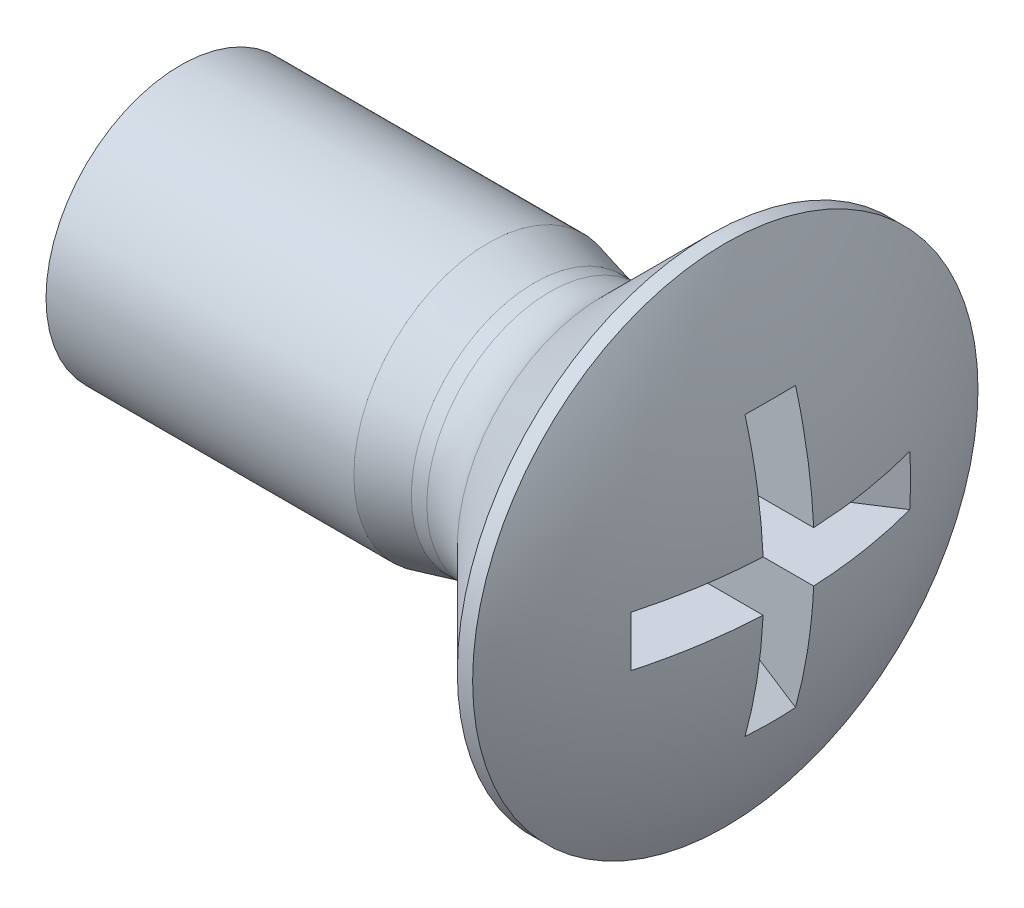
ISO-10303-21;
HEADER;
FILE_DESCRIPTION(('STEP AP214'),'2;1');
FILE_NAME('part.step','',(''),(''),'','','');
FILE_SCHEMA(('AUTOMOTIVE_DESIGN { 1 0 10303 214 1 1 1 1 }'));
ENDSEC;
DATA;
#1=APPLICATION_CONTEXT('core data for automotive mechanical design processes');
#2=APPLICATION_PROTOCOL_DEFINITION('international standard','automotive_design',2000,#1);
#3=PRODUCT_CONTEXT('',#1,'mechanical');
#4=PRODUCT('Part','Part','',(#3));
#5=PRODUCT_RELATED_PRODUCT_CATEGORY('part','',(#4));
#6=PRODUCT_DEFINITION_FORMATION('','',#4);
#7=PRODUCT_DEFINITION_CONTEXT('part definition',#1,'design');
#8=PRODUCT_DEFINITION('design','',#6,#7);
#9=PRODUCT_DEFINITION_SHAPE('','',#8);
#10=(LENGTH_UNIT() NAMED_UNIT(*) SI_UNIT(.MILLI.,.METRE.));
#11=(NAMED_UNIT(*) PLANE_ANGLE_UNIT() SI_UNIT($,.RADIAN.));
#12=(NAMED_UNIT(*) SI_UNIT($,.STERADIAN.) SOLID_ANGLE_UNIT());
#13=UNCERTAINTY_MEASURE_WITH_UNIT(LENGTH_MEASURE(1.E-05),#10,'distance_accuracy_value','');
#14=(GEOMETRIC_REPRESENTATION_CONTEXT(3) GLOBAL_UNCERTAINTY_ASSIGNED_CONTEXT((#13)) GLOBAL_UNIT_ASSIGNED_CONTEXT((#10,
#11,#12)) REPRESENTATION_CONTEXT('',''));
#15=CARTESIAN_POINT('',(0.,0.,0.));
#16=DIRECTION('',(0.,0.,1.));
#17=DIRECTION('',(1.,0.,0.));
#18=AXIS2_PLACEMENT_3D('',#15,#16,#17);
#19=CARTESIAN_POINT('',(8.,-15.525,15.8));
#20=DIRECTION('',(0.,1.,0.));
#21=DIRECTION('',(0.,0.,1.));
#22=AXIS2_PLACEMENT_3D('',#19,#20,#21);
#23=PLANE('',#22);
#24=CARTESIAN_POINT('',(8.41850821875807,-15.525,17.3176700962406));
#25=CARTESIAN_POINT('',(8.46403024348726,-15.525,17.1513480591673));
#26=CARTESIAN_POINT('',(8.5019567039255,-15.525,16.9836632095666));
#27=CARTESIAN_POINT('',(8.56261849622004,-15.525,16.6455678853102));
#28=CARTESIAN_POINT('',(8.58535382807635,-15.525,16.4751574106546));
#29=CARTESIAN_POINT('',(8.6004935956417,-15.525,16.3033841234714));
#30=B_SPLINE_CURVE_WITH_KNOTS('',3,(#24,#25,#26,#27,#28,#29),.UNSPECIFIED.,.F.,.F.,(4,2,4),(0.,
0.515761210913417,1.03152242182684),.UNSPECIFIED.);
#31=CARTESIAN_POINT('',(8.41850821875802,-15.5249999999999,17.3176700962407));
#32=VERTEX_POINT('',#31);
#33=CARTESIAN_POINT('',(8.60049359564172,-15.525,16.3033841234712));
#34=VERTEX_POINT('',#33);
#35=EDGE_CURVE('E21',#32,#34,#30,.T.);
#36=ORIENTED_EDGE('',*,*,#35,.F.);
#37=DIRECTION('',(-0.839314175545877,0.,-0.54364668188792));
#38=VECTOR('',#37,1.);
#39=CARTESIAN_POINT('',(8.7,-15.525,17.5));
#40=LINE('',#39,#38);
#41=CARTESIAN_POINT('',(6.50000000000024,-15.5250000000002,16.0749999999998));
#42=VERTEX_POINT('',#41);
#43=EDGE_CURVE('E124',#42,#32,#40,.F.);
#44=ORIENTED_EDGE('',*,*,#43,.F.);
#45=DIRECTION('',(1.,0.,0.));
#46=VECTOR('',#45,1.);
#47=CARTESIAN_POINT('',(8.,-15.525,16.075));
#48=LINE('',#47,#46);
#49=CARTESIAN_POINT('',(8.616003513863,-15.525,16.075));
#50=VERTEX_POINT('',#49);
#51=EDGE_CURVE('E118',#50,#42,#48,.F.);
#52=ORIENTED_EDGE('',*,*,#51,.F.);
#53=CARTESIAN_POINT('',(8.600493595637,-15.525,16.303384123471));
#54=CARTESIAN_POINT('',(8.61052392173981,-15.525,16.1893465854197));
#55=CARTESIAN_POINT('',(8.616003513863,-15.525,16.075));
#56=B_SPLINE_CURVE_WITH_KNOTS('',2,(#53,#54,#55),.UNSPECIFIED.,.F.,.F.,(3,3),(0.,1.),.UNSPECIFIED.);
#57=EDGE_CURVE('E121',#34,#50,#56,.T.);
#58=ORIENTED_EDGE('',*,*,#57,.F.);
#59=EDGE_LOOP('',(#36,#44,#52,#58));
#60=FACE_BOUND('',#59,.T.);
#61=ADVANCED_FACE('F17',(#60),#23,.F.);
#62=CARTESIAN_POINT('',(8.,-15.8,16.075));
#63=DIRECTION('',(0.,0.,-1.));
#64=DIRECTION('',(0.,1.,0.));
#65=AXIS2_PLACEMENT_3D('',#62,#63,#64);
#66=PLANE('',#65);
#67=DIRECTION('',(0.839314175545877,0.54364668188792,0.));
#68=VECTOR('',#67,1.);
#69=CARTESIAN_POINT('',(8.7,-14.1,16.075));
#70=LINE('',#69,#68);
#71=CARTESIAN_POINT('',(8.41850671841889,-14.2823315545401,16.075));
#72=VERTEX_POINT('',#71);
#73=EDGE_CURVE('E93',#72,#42,#70,.F.);
#74=ORIENTED_EDGE('',*,*,#73,.F.);
#75=CARTESIAN_POINT('',(8.41850853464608,-14.2823310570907,16.075));
#76=CARTESIAN_POINT('',(8.43242250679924,-14.3331313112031,16.075));
#77=CARTESIAN_POINT('',(8.44563750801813,-14.3841229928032,16.075));
#78=CARTESIAN_POINT('',(8.47063224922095,-14.4863352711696,16.075));
#79=CARTESIAN_POINT('',(8.48241515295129,-14.5375550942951,16.075));
#80=CARTESIAN_POINT('',(8.50455447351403,-14.6402216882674,16.075));
#81=CARTESIAN_POINT('',(8.51491300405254,-14.6916680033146,16.075));
#82=CARTESIAN_POINT('',(8.53420944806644,-14.7947862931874,16.075));
#83=CARTESIAN_POINT('',(8.54314842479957,-14.8464580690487,16.075));
#84=CARTESIAN_POINT('',(8.55960843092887,-14.9500269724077,16.075));
#85=CARTESIAN_POINT('',(8.56712946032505,-15.0019240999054,16.075));
#86=CARTESIAN_POINT('',(8.58075308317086,-15.1059439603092,16.075));
#87=CARTESIAN_POINT('',(8.58685460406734,-15.1580668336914,16.075));
#88=CARTESIAN_POINT('',(8.59763538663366,-15.262538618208,16.075));
#89=CARTESIAN_POINT('',(8.60231249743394,-15.3148877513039,16.075));
#90=CARTESIAN_POINT('',(8.61023770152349,-15.4198128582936,16.075));
#91=CARTESIAN_POINT('',(8.6134825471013,-15.4723890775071,16.075));
#92=CARTESIAN_POINT('',(8.61600351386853,-15.5249999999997,16.075));
#93=B_SPLINE_CURVE_WITH_KNOTS('',3,(#75,#76,#77,#78,#79,#80,#81,#82,#83,#84,#85,#86,#87,#88,#89,
#90,#91,#92),.UNSPECIFIED.,.F.,.F.,(4,2,2,2,2,2,2,2,4),(0.,0.15800885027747,0.315662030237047,
0.473078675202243,0.630376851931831,0.787675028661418,0.945091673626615,1.10274485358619,
1.26075370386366),.UNSPECIFIED.);
#94=EDGE_CURVE('E120',#72,#50,#93,.T.);
#95=ORIENTED_EDGE('',*,*,#94,.T.);
#96=ORIENTED_EDGE('',*,*,#51,.T.);
#97=EDGE_LOOP('',(#74,#95,#96));
#98=FACE_BOUND('',#97,.T.);
#99=ADVANCED_FACE('F119',(#98),#66,.T.);
#100=CARTESIAN_POINT('',(8.7,-15.8,17.5));
#101=DIRECTION('',(0.54364668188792,0.,-0.839314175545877));
#102=DIRECTION('',(-0.839314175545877,0.,-0.54364668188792));
#103=AXIS2_PLACEMENT_3D('',#100,#101,#102);
#104=PLANE('',#103);
#105=ORIENTED_EDGE('',*,*,#43,.T.);
#106=CARTESIAN_POINT('',(8.41850821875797,-15.5249999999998,17.3176700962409));
#107=CARTESIAN_POINT('',(8.42236962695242,-15.6166666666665,17.3201712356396));
#108=CARTESIAN_POINT('',(8.42430033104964,-15.7083333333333,17.3214218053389));
#109=CARTESIAN_POINT('',(8.42430033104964,-15.8916666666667,17.3214218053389));
#110=CARTESIAN_POINT('',(8.42236962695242,-15.9833333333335,17.3201712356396));
#111=CARTESIAN_POINT('',(8.41850821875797,-16.0750000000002,17.3176700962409));
#112=B_SPLINE_CURVE_WITH_KNOTS('',3,(#106,#107,#108,#109,#110,#111),.UNSPECIFIED.,.F.,.F.,(4,2,
4),(0.,0.275086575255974,0.550173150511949),.UNSPECIFIED.);
#113=CARTESIAN_POINT('',(8.41850821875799,-16.0750000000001,17.3176700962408));
#114=VERTEX_POINT('',#113);
#115=EDGE_CURVE('E103',#32,#114,#112,.T.);
#116=ORIENTED_EDGE('',*,*,#115,.T.);
#117=DIRECTION('',(0.839314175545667,0.,0.543646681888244));
#118=VECTOR('',#117,1.);
#119=CARTESIAN_POINT('',(6.5,-16.075,16.075));
#120=LINE('',#119,#118);
#121=CARTESIAN_POINT('',(6.50000000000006,-16.075,16.0749999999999));
#122=VERTEX_POINT('',#121);
#123=EDGE_CURVE('E129',#122,#114,#120,.T.);
#124=ORIENTED_EDGE('',*,*,#123,.F.);
#125=DIRECTION('',(0.,1.,0.));
#126=VECTOR('',#125,1.);
#127=CARTESIAN_POINT('',(6.5000000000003,-15.8,16.0749999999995));
#128=LINE('',#127,#126);
#129=EDGE_CURVE('E111',#122,#42,#128,.T.);
#130=ORIENTED_EDGE('',*,*,#129,.T.);
#131=EDGE_LOOP('',(#105,#116,#124,#130));
#132=FACE_BOUND('',#131,.T.);
#133=ADVANCED_FACE('F127',(#132),#104,.T.);
#134=CARTESIAN_POINT('',(8.7,-14.1,15.8));
#135=DIRECTION('',(0.54364668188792,-0.839314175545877,0.));
#136=DIRECTION('',(0.839314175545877,0.54364668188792,0.));
#137=AXIS2_PLACEMENT_3D('',#134,#135,#136);
#138=PLANE('',#137);
#139=DIRECTION('',(0.839314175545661,0.543646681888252,0.));
#140=VECTOR('',#139,1.);
#141=CARTESIAN_POINT('',(6.5,-15.525,15.525));
#142=LINE('',#141,#140);
#143=CARTESIAN_POINT('',(6.50000000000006,-15.5250000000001,15.525));
#144=VERTEX_POINT('',#143);
#145=CARTESIAN_POINT('',(8.41850789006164,-14.2823301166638,15.524999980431));
#146=VERTEX_POINT('',#145);
#147=EDGE_CURVE('E233',#144,#146,#142,.T.);
#148=ORIENTED_EDGE('',*,*,#147,.T.);
#149=CARTESIAN_POINT('',(8.41850821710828,-14.2823299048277,15.5249999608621));
#150=CARTESIAN_POINT('',(8.4223696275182,-14.279828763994,15.61666666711));
#151=CARTESIAN_POINT('',(8.42430033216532,-14.2785781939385,15.7083333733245));
#152=CARTESIAN_POINT('',(8.42430032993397,-14.2785781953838,15.8916667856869));
#153=CARTESIAN_POINT('',(8.42236962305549,-14.2798287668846,15.9833334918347));
#154=CARTESIAN_POINT('',(8.41850821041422,-14.2823299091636,16.0750001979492));
#155=B_SPLINE_CURVE_WITH_KNOTS('',3,(#149,#150,#151,#152,#153,#154),.UNSPECIFIED.,.F.,.F.,(4,2,
4),(0.,0.275086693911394,0.55017338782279),.UNSPECIFIED.);
#156=EDGE_CURVE('E99',#146,#72,#155,.T.);
#157=ORIENTED_EDGE('',*,*,#156,.T.);
#158=ORIENTED_EDGE('',*,*,#73,.T.);
#159=DIRECTION('',(0.,0.,1.));
#160=VECTOR('',#159,1.);
#161=CARTESIAN_POINT('',(6.5000000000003,-15.5250000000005,15.8));
#162=LINE('',#161,#160);
#163=EDGE_CURVE('E97',#42,#144,#162,.F.);
#164=ORIENTED_EDGE('',*,*,#163,.T.);
#165=EDGE_LOOP('',(#148,#157,#158,#164));
#166=FACE_BOUND('',#165,.T.);
#167=ADVANCED_FACE('F96',(#166),#138,.T.);
#168=CARTESIAN_POINT('',(8.,-16.075,15.8));
#169=DIRECTION('',(0.,1.,0.));
#170=DIRECTION('',(0.,0.,1.));
#171=AXIS2_PLACEMENT_3D('',#168,#169,#170);
#172=PLANE('',#171);
#173=ORIENTED_EDGE('',*,*,#123,.T.);
#174=CARTESIAN_POINT('',(8.418508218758,-16.075,17.3176700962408));
#175=CARTESIAN_POINT('',(8.43242221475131,-16.075,17.2668697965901));
#176=CARTESIAN_POINT('',(8.44563723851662,-16.075,17.215878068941));
#177=CARTESIAN_POINT('',(8.47063202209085,-16.075,17.113665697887));
#178=CARTESIAN_POINT('',(8.48241494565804,-16.075,17.0624458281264));
#179=CARTESIAN_POINT('',(8.50455430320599,-16.075,16.9597791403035));
#180=CARTESIAN_POINT('',(8.51491285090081,-16.075,16.9083327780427));
#181=CARTESIAN_POINT('',(8.53420932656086,-16.075,16.8052143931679));
#182=CARTESIAN_POINT('',(8.54314831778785,-16.075,16.7535425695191));
#183=CARTESIAN_POINT('',(8.55960835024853,-16.075,16.6499735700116));
#184=CARTESIAN_POINT('',(8.56712939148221,-16.075,16.598076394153));
#185=CARTESIAN_POINT('',(8.58075303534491,-16.075,16.4940564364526));
#186=CARTESIAN_POINT('',(8.58685456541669,-16.075,16.4419335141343));
#187=CARTESIAN_POINT('',(8.59763536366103,-16.075,16.3374616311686));
#188=CARTESIAN_POINT('',(8.60231248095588,-16.075,16.2851124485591));
#189=CARTESIAN_POINT('',(8.6102376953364,-16.075,16.1801872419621));
#190=CARTESIAN_POINT('',(8.61348254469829,-16.075,16.1276109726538));
#191=CARTESIAN_POINT('',(8.61600351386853,-16.075,16.0750000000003));
#192=B_SPLINE_CURVE_WITH_KNOTS('',3,(#174,#175,#176,#177,#178,#179,#180,#181,#182,#183,#184,
#185,#186,#187,#188,#189,#190,#191),.UNSPECIFIED.,.F.,.F.,(4,2,2,2,2,2,2,2,4),(0.,
0.158009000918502,0.315662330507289,0.473079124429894,0.630377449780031,0.787675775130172,
0.945092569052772,1.10274589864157,1.26075489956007),.UNSPECIFIED.);
#193=CARTESIAN_POINT('',(8.61600351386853,-16.0750000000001,16.0750000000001));
#194=VERTEX_POINT('',#193);
#195=EDGE_CURVE('E235',#114,#194,#192,.T.);
#196=ORIENTED_EDGE('',*,*,#195,.T.);
#197=DIRECTION('',(1.,0.,0.));
#198=VECTOR('',#197,1.);
#199=CARTESIAN_POINT('',(8.,-16.075,16.075));
#200=LINE('',#199,#198);
#201=EDGE_CURVE('E227',#122,#194,#200,.T.);
#202=ORIENTED_EDGE('',*,*,#201,.F.);
#203=EDGE_LOOP('',(#173,#196,#202));
#204=FACE_BOUND('',#203,.T.);
#205=ADVANCED_FACE('F266',(#204),#172,.T.);
#206=CARTESIAN_POINT('',(8.,-15.8,15.525));
#207=DIRECTION('',(0.,0.,-1.));
#208=DIRECTION('',(0.,1.,0.));
#209=AXIS2_PLACEMENT_3D('',#206,#207,#208);
#210=PLANE('',#209);
#211=ORIENTED_EDGE('',*,*,#147,.F.);
#212=DIRECTION('',(1.,0.,0.));
#213=VECTOR('',#212,1.);
#214=CARTESIAN_POINT('',(8.,-15.525,15.525));
#215=LINE('',#214,#213);
#216=CARTESIAN_POINT('',(8.61600351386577,-15.5249999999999,15.525));
#217=VERTEX_POINT('',#216);
#218=EDGE_CURVE('E221',#144,#217,#215,.T.);
#219=ORIENTED_EDGE('',*,*,#218,.T.);
#220=CARTESIAN_POINT('',(8.41850828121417,-14.2823301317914,15.525));
#221=CARTESIAN_POINT('',(8.43242227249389,-14.3331304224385,15.525));
#222=CARTESIAN_POINT('',(8.44563729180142,-14.3841221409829,15.525));
#223=CARTESIAN_POINT('',(8.47063206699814,-14.4863344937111,15.525));
#224=CARTESIAN_POINT('',(8.48241498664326,-14.5375543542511,15.525));
#225=CARTESIAN_POINT('',(8.50455433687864,-14.6402210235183,15.525));
#226=CARTESIAN_POINT('',(8.51491288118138,-14.6916673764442,15.525));
#227=CARTESIAN_POINT('',(8.53420935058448,-14.7947857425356,15.525));
#228=CARTESIAN_POINT('',(8.5431483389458,-14.846457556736,15.525));
#229=CARTESIAN_POINT('',(8.55960836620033,-14.9500265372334,15.525));
#230=CARTESIAN_POINT('',(8.56712940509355,-15.0019237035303,15.525));
#231=CARTESIAN_POINT('',(8.58075304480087,-15.1059436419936,15.525));
#232=CARTESIAN_POINT('',(8.58685457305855,-15.1580665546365,15.525));
#233=CARTESIAN_POINT('',(8.59763536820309,-15.2625384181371,15.525));
#234=CARTESIAN_POINT('',(8.60231248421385,-15.314887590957,15.525));
#235=CARTESIAN_POINT('',(8.61023769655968,-15.4198127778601,15.525));
#236=CARTESIAN_POINT('',(8.6134825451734,-15.4723890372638,15.525));
#237=CARTESIAN_POINT('',(8.61600351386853,-15.5249999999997,15.525));
#238=B_SPLINE_CURVE_WITH_KNOTS('',3,(#220,#221,#222,#223,#224,#225,#226,#227,#228,#229,#230,
#231,#232,#233,#234,#235,#236,#237),.UNSPECIFIED.,.F.,.F.,(4,2,2,2,2,2,2,2,4),(0.,
0.15800897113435,0.315662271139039,0.473079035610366,0.630377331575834,0.787675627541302,
0.945092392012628,1.10274569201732,1.26075466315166),.UNSPECIFIED.);
#239=EDGE_CURVE('E230',#146,#217,#238,.T.);
#240=ORIENTED_EDGE('',*,*,#239,.F.);
#241=EDGE_LOOP('',(#211,#219,#240));
#242=FACE_BOUND('',#241,.T.);
#243=ADVANCED_FACE('F387',(#242),#210,.F.);
#244=CARTESIAN_POINT('',(8.,-15.8,16.075));
#245=DIRECTION('',(0.,0.,-1.));
#246=DIRECTION('',(0.,1.,0.));
#247=AXIS2_PLACEMENT_3D('',#244,#245,#246);
#248=PLANE('',#247);
#249=ORIENTED_EDGE('',*,*,#201,.T.);
#250=CARTESIAN_POINT('',(8.61600351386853,-16.0750000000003,16.075));
#251=CARTESIAN_POINT('',(8.6134825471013,-16.1276109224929,16.075));
#252=CARTESIAN_POINT('',(8.61023770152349,-16.1801871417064,16.075));
#253=CARTESIAN_POINT('',(8.60231249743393,-16.2851122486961,16.075));
#254=CARTESIAN_POINT('',(8.59763538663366,-16.337461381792,16.075));
#255=CARTESIAN_POINT('',(8.58685460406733,-16.4419331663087,16.075));
#256=CARTESIAN_POINT('',(8.58075308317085,-16.4940560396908,16.075));
#257=CARTESIAN_POINT('',(8.56712946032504,-16.5980759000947,16.075));
#258=CARTESIAN_POINT('',(8.55960843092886,-16.6499730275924,16.075));
#259=CARTESIAN_POINT('',(8.54314842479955,-16.7535419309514,16.075));
#260=CARTESIAN_POINT('',(8.53420944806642,-16.8052137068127,16.075));
#261=CARTESIAN_POINT('',(8.51491300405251,-16.9083319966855,16.075));
#262=CARTESIAN_POINT('',(8.504554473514,-16.9597783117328,16.075));
#263=CARTESIAN_POINT('',(8.48241515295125,-17.0624449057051,16.075));
#264=CARTESIAN_POINT('',(8.47063224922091,-17.1136647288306,16.075));
#265=CARTESIAN_POINT('',(8.44563750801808,-17.215877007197,16.075));
#266=CARTESIAN_POINT('',(8.43242250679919,-17.2668686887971,16.075));
#267=CARTESIAN_POINT('',(8.41850853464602,-17.3176689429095,16.075));
#268=B_SPLINE_CURVE_WITH_KNOTS('',3,(#250,#251,#252,#253,#254,#255,#256,#257,#258,#259,#260,
#261,#262,#263,#264,#265,#266,#267),.UNSPECIFIED.,.F.,.F.,(4,2,2,2,2,2,2,2,4),(0.,
0.158008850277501,0.3156620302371,0.473078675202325,0.63037685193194,0.787675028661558,
0.945091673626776,1.10274485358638,1.26075370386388),.UNSPECIFIED.);
#269=CARTESIAN_POINT('',(8.41850837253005,-17.3176695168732,16.0750000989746));
#270=VERTEX_POINT('',#269);
#271=EDGE_CURVE('E224',#194,#270,#268,.T.);
#272=ORIENTED_EDGE('',*,*,#271,.T.);
#273=DIRECTION('',(-0.839314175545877,0.54364668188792,0.));
#274=VECTOR('',#273,1.);
#275=CARTESIAN_POINT('',(6.5,-16.075,16.075));
#276=LINE('',#275,#274);
#277=EDGE_CURVE('E210',#122,#270,#276,.F.);
#278=ORIENTED_EDGE('',*,*,#277,.F.);
#279=EDGE_LOOP('',(#249,#272,#278));
#280=FACE_BOUND('',#279,.T.);
#281=ADVANCED_FACE('F335',(#280),#248,.T.);
#282=CARTESIAN_POINT('',(8.,-15.525,15.8));
#283=DIRECTION('',(0.,1.,0.));
#284=DIRECTION('',(0.,0.,1.));
#285=AXIS2_PLACEMENT_3D('',#282,#283,#284);
#286=PLANE('',#285);
#287=ORIENTED_EDGE('',*,*,#218,.F.);
#288=DIRECTION('',(0.839314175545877,0.,-0.54364668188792));
#289=VECTOR('',#288,1.);
#290=CARTESIAN_POINT('',(6.5,-15.525,15.525));
#291=LINE('',#290,#289);
#292=CARTESIAN_POINT('',(8.41850821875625,-15.525,14.28232990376));
#293=VERTEX_POINT('',#292);
#294=EDGE_CURVE('E202',#293,#144,#291,.F.);
#295=ORIENTED_EDGE('',*,*,#294,.F.);
#296=CARTESIAN_POINT('',(8.61600351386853,-15.525,15.5249999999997));
#297=CARTESIAN_POINT('',(8.61348254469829,-15.525,15.4723890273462));
#298=CARTESIAN_POINT('',(8.6102376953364,-15.525,15.4198127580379));
#299=CARTESIAN_POINT('',(8.60231248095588,-15.525,15.3148875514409));
#300=CARTESIAN_POINT('',(8.59763536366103,-15.525,15.2625383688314));
#301=CARTESIAN_POINT('',(8.58685456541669,-15.525,15.1580664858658));
#302=CARTESIAN_POINT('',(8.58075303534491,-15.525,15.1059435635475));
#303=CARTESIAN_POINT('',(8.56712939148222,-15.525,15.0019236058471));
#304=CARTESIAN_POINT('',(8.55960835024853,-15.525,14.9500264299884));
#305=CARTESIAN_POINT('',(8.54314831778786,-15.525,14.8464574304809));
#306=CARTESIAN_POINT('',(8.53420932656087,-15.525,14.7947856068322));
#307=CARTESIAN_POINT('',(8.51491285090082,-15.525,14.6916672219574));
#308=CARTESIAN_POINT('',(8.504554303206,-15.525,14.6402208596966));
#309=CARTESIAN_POINT('',(8.48241494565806,-15.525,14.5375541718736));
#310=CARTESIAN_POINT('',(8.47063202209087,-15.525,14.4863343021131));
#311=CARTESIAN_POINT('',(8.44563723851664,-15.525,14.3841219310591));
#312=CARTESIAN_POINT('',(8.43242221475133,-15.525,14.33313020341));
#313=CARTESIAN_POINT('',(8.41850821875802,-15.525,14.2823299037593));
#314=B_SPLINE_CURVE_WITH_KNOTS('',3,(#296,#297,#298,#299,#300,#301,#302,#303,#304,#305,#306,
#307,#308,#309,#310,#311,#312,#313),.UNSPECIFIED.,.F.,.F.,(4,2,2,2,2,2,2,2,4),(0.,
0.158009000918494,0.315662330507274,0.473079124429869,0.630377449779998,0.787675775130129,
0.945092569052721,1.1027458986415,1.26075489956),.UNSPECIFIED.);
#315=EDGE_CURVE('E218',#217,#293,#314,.T.);
#316=ORIENTED_EDGE('',*,*,#315,.F.);
#317=EDGE_LOOP('',(#287,#295,#316));
#318=FACE_BOUND('',#317,.T.);
#319=ADVANCED_FACE('F368',(#318),#286,.F.);
#320=CARTESIAN_POINT('',(6.5,-15.8,16.075));
#321=DIRECTION('',(1.,0.,0.));
#322=DIRECTION('',(0.,0.,-1.));
#323=AXIS2_PLACEMENT_3D('',#320,#321,#322);
#324=PLANE('',#323);
#325=DIRECTION('',(0.,1.,0.));
#326=VECTOR('',#325,1.);
#327=CARTESIAN_POINT('',(6.5,-15.8,15.525));
#328=LINE('',#327,#326);
#329=CARTESIAN_POINT('',(6.5,-16.075,15.525));
#330=VERTEX_POINT('',#329);
#331=EDGE_CURVE('E114',#144,#330,#328,.F.);
#332=ORIENTED_EDGE('',*,*,#331,.F.);
#333=ORIENTED_EDGE('',*,*,#163,.F.);
#334=ORIENTED_EDGE('',*,*,#129,.F.);
#335=DIRECTION('',(0.,0.,1.));
#336=VECTOR('',#335,1.);
#337=CARTESIAN_POINT('',(6.5,-16.075,15.8));
#338=LINE('',#337,#336);
#339=EDGE_CURVE('E213',#330,#122,#338,.T.);
#340=ORIENTED_EDGE('',*,*,#339,.F.);
#341=EDGE_LOOP('',(#332,#333,#334,#340));
#342=FACE_BOUND('',#341,.T.);
#343=ADVANCED_FACE('F108',(#342),#324,.T.);
#344=CARTESIAN_POINT('',(6.5,-16.075,15.8));
#345=DIRECTION('',(0.54364668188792,0.839314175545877,0.));
#346=DIRECTION('',(-0.839314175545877,0.54364668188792,0.));
#347=AXIS2_PLACEMENT_3D('',#344,#345,#346);
#348=PLANE('',#347);
#349=ORIENTED_EDGE('',*,*,#277,.T.);
#350=CARTESIAN_POINT('',(8.41850821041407,-17.317670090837,16.0750001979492));
#351=CARTESIAN_POINT('',(8.42236962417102,-17.3201712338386,15.9833334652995));
#352=CARTESIAN_POINT('',(8.42430033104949,-17.3214218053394,15.8916667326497));
#353=CARTESIAN_POINT('',(8.42430033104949,-17.3214218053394,15.7083332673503));
#354=CARTESIAN_POINT('',(8.42236962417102,-17.3201712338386,15.6166665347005));
#355=CARTESIAN_POINT('',(8.41850821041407,-17.317670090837,15.5249998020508));
#356=B_SPLINE_CURVE_WITH_KNOTS('',3,(#350,#351,#352,#353,#354,#355),.UNSPECIFIED.,.F.,.F.,(4,2,
4),(0.,0.275086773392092,0.55017354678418),.UNSPECIFIED.);
#357=CARTESIAN_POINT('',(8.41850837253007,-17.3176695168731,15.5249999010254));
#358=VERTEX_POINT('',#357);
#359=EDGE_CURVE('E204',#270,#358,#356,.T.);
#360=ORIENTED_EDGE('',*,*,#359,.T.);
#361=DIRECTION('',(-0.839314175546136,0.54364668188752,0.));
#362=VECTOR('',#361,1.);
#363=CARTESIAN_POINT('',(8.418504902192,-17.31766794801,15.525));
#364=LINE('',#363,#362);
#365=EDGE_CURVE('E196',#358,#330,#364,.T.);
#366=ORIENTED_EDGE('',*,*,#365,.T.);
#367=ORIENTED_EDGE('',*,*,#339,.T.);
#368=EDGE_LOOP('',(#349,#360,#366,#367));
#369=FACE_BOUND('',#368,.T.);
#370=ADVANCED_FACE('F337',(#369),#348,.T.);
#371=CARTESIAN_POINT('',(6.5,-15.8,15.525));
#372=DIRECTION('',(0.54364668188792,0.,0.839314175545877));
#373=DIRECTION('',(0.839314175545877,0.,-0.54364668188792));
#374=AXIS2_PLACEMENT_3D('',#371,#372,#373);
#375=PLANE('',#374);
#376=DIRECTION('',(-0.839314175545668,0.,0.543646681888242));
#377=VECTOR('',#376,1.);
#378=CARTESIAN_POINT('',(8.418508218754,-16.075,14.28232990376));
#379=LINE('',#378,#377);
#380=CARTESIAN_POINT('',(8.41850821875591,-16.0750000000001,14.2823299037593));
#381=VERTEX_POINT('',#380);
#382=EDGE_CURVE('E189',#381,#330,#379,.T.);
#383=ORIENTED_EDGE('',*,*,#382,.F.);
#384=CARTESIAN_POINT('',(8.41850821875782,-16.0750000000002,14.2823299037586));
#385=CARTESIAN_POINT('',(8.42236962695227,-15.9833333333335,14.2798287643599));
#386=CARTESIAN_POINT('',(8.42430033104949,-15.8916666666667,14.2785781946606));
#387=CARTESIAN_POINT('',(8.42430033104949,-15.7083333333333,14.2785781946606));
#388=CARTESIAN_POINT('',(8.42236962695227,-15.6166666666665,14.2798287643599));
#389=CARTESIAN_POINT('',(8.41850821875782,-15.5249999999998,14.2823299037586));
#390=B_SPLINE_CURVE_WITH_KNOTS('',3,(#384,#385,#386,#387,#388,#389),.UNSPECIFIED.,.F.,.F.,(4,2,
4),(0.,0.275086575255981,0.550173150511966),.UNSPECIFIED.);
#391=EDGE_CURVE('E199',#381,#293,#390,.T.);
#392=ORIENTED_EDGE('',*,*,#391,.T.);
#393=ORIENTED_EDGE('',*,*,#294,.T.);
#394=ORIENTED_EDGE('',*,*,#331,.T.);
#395=EDGE_LOOP('',(#383,#392,#393,#394));
#396=FACE_BOUND('',#395,.T.);
#397=ADVANCED_FACE('F346',(#396),#375,.T.);
#398=CARTESIAN_POINT('',(8.,-15.8,15.525));
#399=DIRECTION('',(0.,0.,-1.));
#400=DIRECTION('',(0.,1.,0.));
#401=AXIS2_PLACEMENT_3D('',#398,#399,#400);
#402=PLANE('',#401);
#403=DIRECTION('',(1.,0.,0.));
#404=VECTOR('',#403,1.);
#405=CARTESIAN_POINT('',(8.,-16.075,15.525));
#406=LINE('',#405,#404);
#407=CARTESIAN_POINT('',(8.61600351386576,-16.0750000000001,15.525));
#408=VERTEX_POINT('',#407);
#409=EDGE_CURVE('E182',#330,#408,#406,.T.);
#410=ORIENTED_EDGE('',*,*,#409,.F.);
#411=ORIENTED_EDGE('',*,*,#365,.F.);
#412=CARTESIAN_POINT('',(8.61600351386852,-16.0750000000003,15.525));
#413=CARTESIAN_POINT('',(8.6134825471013,-16.1276109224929,15.525));
#414=CARTESIAN_POINT('',(8.61023770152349,-16.1801871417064,15.525));
#415=CARTESIAN_POINT('',(8.60231249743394,-16.2851122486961,15.525));
#416=CARTESIAN_POINT('',(8.59763538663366,-16.337461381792,15.525));
#417=CARTESIAN_POINT('',(8.58685460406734,-16.4419331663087,15.525));
#418=CARTESIAN_POINT('',(8.58075308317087,-16.4940560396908,15.525));
#419=CARTESIAN_POINT('',(8.56712946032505,-16.5980759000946,15.525));
#420=CARTESIAN_POINT('',(8.55960843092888,-16.6499730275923,15.525));
#421=CARTESIAN_POINT('',(8.54314842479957,-16.7535419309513,15.525));
#422=CARTESIAN_POINT('',(8.53420944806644,-16.8052137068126,15.525));
#423=CARTESIAN_POINT('',(8.51491300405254,-16.9083319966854,15.525));
#424=CARTESIAN_POINT('',(8.50455447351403,-16.9597783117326,15.525));
#425=CARTESIAN_POINT('',(8.48241515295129,-17.0624449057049,15.525));
#426=CARTESIAN_POINT('',(8.47063224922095,-17.1136647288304,15.525));
#427=CARTESIAN_POINT('',(8.44563750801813,-17.2158770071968,15.525));
#428=CARTESIAN_POINT('',(8.43242250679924,-17.2668686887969,15.525));
#429=CARTESIAN_POINT('',(8.41850853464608,-17.3176689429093,15.525));
#430=B_SPLINE_CURVE_WITH_KNOTS('',3,(#412,#413,#414,#415,#416,#417,#418,#419,#420,#421,#422,
#423,#424,#425,#426,#427,#428,#429),.UNSPECIFIED.,.F.,.F.,(4,2,2,2,2,2,2,2,4),(0.,
0.15800885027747,0.315662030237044,0.473078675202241,0.630376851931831,0.78767502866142,
0.945091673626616,1.10274485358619,1.26075370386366),.UNSPECIFIED.);
#431=EDGE_CURVE('E160',#408,#358,#430,.T.);
#432=ORIENTED_EDGE('',*,*,#431,.F.);
#433=EDGE_LOOP('',(#410,#411,#432));
#434=FACE_BOUND('',#433,.T.);
#435=ADVANCED_FACE('F174',(#434),#402,.F.);
#436=CARTESIAN_POINT('',(8.,-16.075,15.8));
#437=DIRECTION('',(0.,1.,0.));
#438=DIRECTION('',(0.,0.,1.));
#439=AXIS2_PLACEMENT_3D('',#436,#437,#438);
#440=PLANE('',#439);
#441=CARTESIAN_POINT('',(8.616003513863,-16.075,15.525));
#442=CARTESIAN_POINT('',(8.61052392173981,-16.075,15.4106534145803));
#443=CARTESIAN_POINT('',(8.600493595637,-16.075,15.296615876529));
#444=B_SPLINE_CURVE_WITH_KNOTS('',2,(#441,#442,#443),.UNSPECIFIED.,.F.,.F.,(3,3),(0.,1.),.UNSPECIFIED.);
#445=CARTESIAN_POINT('',(8.60049359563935,-16.075,15.2966158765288));
#446=VERTEX_POINT('',#445);
#447=EDGE_CURVE('E41',#408,#446,#444,.T.);
#448=ORIENTED_EDGE('',*,*,#447,.T.);
#449=CARTESIAN_POINT('',(8.41850821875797,-16.075,14.2823299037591));
#450=CARTESIAN_POINT('',(8.4640302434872,-16.075,14.4486519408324));
#451=CARTESIAN_POINT('',(8.50195670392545,-16.075,14.6163367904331));
#452=CARTESIAN_POINT('',(8.56261849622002,-16.075,14.9544321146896));
#453=CARTESIAN_POINT('',(8.58535382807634,-16.075,15.1248425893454));
#454=CARTESIAN_POINT('',(8.6004935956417,-16.075,15.2966158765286));
#455=B_SPLINE_CURVE_WITH_KNOTS('',3,(#449,#450,#451,#452,#453,#454),.UNSPECIFIED.,.F.,.F.,(4,2,
4),(0.,0.515761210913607,1.03152242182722),.UNSPECIFIED.);
#456=EDGE_CURVE('E153',#381,#446,#455,.T.);
#457=ORIENTED_EDGE('',*,*,#456,.F.);
#458=ORIENTED_EDGE('',*,*,#382,.T.);
#459=ORIENTED_EDGE('',*,*,#409,.T.);
#460=EDGE_LOOP('',(#448,#457,#458,#459));
#461=FACE_BOUND('',#460,.T.);
#462=ADVANCED_FACE('F171',(#461),#440,.T.);
#463=CARTESIAN_POINT('',(2.87738095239,-15.8,15.8));
#464=DIRECTION('',(0.,0.479425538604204,0.877582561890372));
#465=DIRECTION('',(0.,-0.877582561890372,0.479425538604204));
#466=AXIS2_PLACEMENT_3D('',#463,#464,#465);
#467=SPHERICAL_SURFACE('',#466,5.75178571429);
#468=CARTESIAN_POINT('',(7.9291666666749,-15.8,15.8));
#469=DIRECTION('',(-1.,0.,0.));
#470=DIRECTION('',(0.,0.,1.));
#471=AXIS2_PLACEMENT_3D('',#468,#469,#470);
#472=CIRCLE('',#471,2.75);
#473=CARTESIAN_POINT('',(7.9291666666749,-15.8,18.55));
#474=VERTEX_POINT('',#473);
#475=EDGE_CURVE('E149',#474,#474,#472,.T.);
#476=ORIENTED_EDGE('',*,*,#475,.F.);
#477=EDGE_LOOP('',(#476));
#478=FACE_BOUND('',#477,.T.);
#479=ORIENTED_EDGE('',*,*,#115,.F.);
#480=ORIENTED_EDGE('',*,*,#35,.T.);
#481=ORIENTED_EDGE('',*,*,#57,.T.);
#482=ORIENTED_EDGE('',*,*,#94,.F.);
#483=ORIENTED_EDGE('',*,*,#156,.F.);
#484=ORIENTED_EDGE('',*,*,#239,.T.);
#485=ORIENTED_EDGE('',*,*,#315,.T.);
#486=ORIENTED_EDGE('',*,*,#391,.F.);
#487=ORIENTED_EDGE('',*,*,#456,.T.);
#488=ORIENTED_EDGE('',*,*,#447,.F.);
#489=ORIENTED_EDGE('',*,*,#431,.T.);
#490=ORIENTED_EDGE('',*,*,#359,.F.);
#491=ORIENTED_EDGE('',*,*,#271,.F.);
#492=ORIENTED_EDGE('',*,*,#195,.F.);
#493=EDGE_LOOP('',(#479,#480,#481,#482,#483,#484,#485,#486,#487,#488,#489,#490,#491,#492));
#494=FACE_BOUND('',#493,.T.);
#495=ADVANCED_FACE('F167',(#478,#494),#467,.T.);
#496=CARTESIAN_POINT('',(5.31458333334,-15.8,15.8));
#497=DIRECTION('',(-1.,0.,0.));
#498=DIRECTION('',(0.,0.,1.));
#499=AXIS2_PLACEMENT_3D('',#496,#497,#498);
#500=CYLINDRICAL_SURFACE('',#499,2.75);
#501=CARTESIAN_POINT('',(7.76250000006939,-15.8,15.8));
#502=DIRECTION('',(1.,0.,0.));
#503=DIRECTION('',(0.,0.479425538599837,0.877582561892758));
#504=AXIS2_PLACEMENT_3D('',#501,#502,#503);
#505=CIRCLE('',#504,2.75000000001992);
#506=CARTESIAN_POINT('',(7.76250000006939,-14.4815797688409,18.2133520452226));
#507=VERTEX_POINT('',#506);
#508=EDGE_CURVE('E152',#507,#507,#505,.F.);
#509=ORIENTED_EDGE('',*,*,#508,.F.);
#510=EDGE_LOOP('',(#509));
#511=FACE_BOUND('',#510,.T.);
#512=ORIENTED_EDGE('',*,*,#475,.T.);
#513=EDGE_LOOP('',(#512));
#514=FACE_BOUND('',#513,.T.);
#515=ADVANCED_FACE('F323',(#511,#514),#500,.T.);
#516=CARTESIAN_POINT('',(7.76250000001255,-15.8,15.8));
#517=DIRECTION('',(1.,0.,0.));
#518=DIRECTION('',(0.,0.,-1.));
#519=AXIS2_PLACEMENT_3D('',#516,#517,#518);
#520=CONICAL_SURFACE('',#519,2.74999999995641,0.785398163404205);
#521=ORIENTED_EDGE('',*,*,#508,.T.);
#522=EDGE_LOOP('',(#521));
#523=FACE_BOUND('',#522,.T.);
#524=CARTESIAN_POINT('',(6.58431457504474,-15.8,15.8));
#525=DIRECTION('',(1.,0.,0.));
#526=DIRECTION('',(0.,0.479425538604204,0.877582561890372));
#527=AXIS2_PLACEMENT_3D('',#524,#525,#526);
#528=CIRCLE('',#527,1.57181457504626);
#529=CARTESIAN_POINT('',(6.58431457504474,-15.0464319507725,17.1793970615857));
#530=VERTEX_POINT('',#529);
#531=EDGE_CURVE('E314',#530,#530,#528,.T.);
#532=ORIENTED_EDGE('',*,*,#531,.T.);
#533=EDGE_LOOP('',(#532));
#534=FACE_BOUND('',#533,.T.);
#535=ADVANCED_FACE('F305',(#523,#534),#520,.T.);
#536=CARTESIAN_POINT('',(6.0186291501,-15.8,15.8));
#537=DIRECTION('',(1.,0.,0.));
#538=DIRECTION('',(0.,0.479425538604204,0.877582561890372));
#539=AXIS2_PLACEMENT_3D('',#536,#537,#538);
#540=TOROIDAL_SURFACE('',#539,2.1375,0.8);
#541=ORIENTED_EDGE('',*,*,#531,.F.);
#542=EDGE_LOOP('',(#541));
#543=FACE_BOUND('',#542,.T.);
#544=CARTESIAN_POINT('',(6.0186291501,-15.8,15.8));
#545=DIRECTION('',(-1.,0.,0.));
#546=DIRECTION('',(0.,0.,1.));
#547=AXIS2_PLACEMENT_3D('',#544,#545,#546);
#548=CIRCLE('',#547,1.3375);
#549=CARTESIAN_POINT('',(6.0186291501,-15.8,17.1375));
#550=VERTEX_POINT('',#549);
#551=EDGE_CURVE('E311',#550,#550,#548,.T.);
#552=ORIENTED_EDGE('',*,*,#551,.F.);
#553=EDGE_LOOP('',(#552));
#554=FACE_BOUND('',#553,.T.);
#555=ADVANCED_FACE('F300',(#543,#554),#540,.F.);
#556=CARTESIAN_POINT('',(5.31458333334,-15.8,15.8));
#557=DIRECTION('',(-1.,0.,0.));
#558=DIRECTION('',(0.,0.,1.));
#559=AXIS2_PLACEMENT_3D('',#556,#557,#558);
#560=CYLINDRICAL_SURFACE('',#559,1.3375);
#561=CARTESIAN_POINT('',(5.85000000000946,-15.8,15.8));
#562=DIRECTION('',(-1.,0.,0.));
#563=DIRECTION('',(0.,0.479425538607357,0.87758256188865));
#564=AXIS2_PLACEMENT_3D('',#561,#562,#563);
#565=CIRCLE('',#564,1.3375000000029);
#566=CARTESIAN_POINT('',(5.85000000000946,-15.1587683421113,16.9737666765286));
#567=VERTEX_POINT('',#566);
#568=EDGE_CURVE('E148',#567,#567,#565,.T.);
#569=ORIENTED_EDGE('',*,*,#568,.F.);
#570=EDGE_LOOP('',(#569));
#571=FACE_BOUND('',#570,.T.);
#572=ORIENTED_EDGE('',*,*,#551,.T.);
#573=EDGE_LOOP('',(#572));
#574=FACE_BOUND('',#573,.T.);
#575=ADVANCED_FACE('F296',(#571,#574),#560,.T.);
#576=CARTESIAN_POINT('',(2.,-15.8,17.26341463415));
#577=DIRECTION('',(-1.,0.,0.));
#578=DIRECTION('',(0.,0.,1.));
#579=AXIS2_PLACEMENT_3D('',#576,#577,#578);
#580=PLANE('',#579);
#581=CARTESIAN_POINT('',(2.,-15.8,15.8));
#582=DIRECTION('',(-1.,0.,0.));
#583=DIRECTION('',(0.,0.,1.));
#584=AXIS2_PLACEMENT_3D('',#581,#582,#583);
#585=CIRCLE('',#584,1.46341463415);
#586=CARTESIAN_POINT('',(2.,-15.8,17.26341463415));
#587=VERTEX_POINT('',#586);
#588=EDGE_CURVE('E32',#587,#587,#585,.F.);
#589=ORIENTED_EDGE('',*,*,#588,.F.);
#590=EDGE_LOOP('',(#589));
#591=FACE_BOUND('',#590,.T.);
#592=ADVANCED_FACE('F289',(#591),#580,.T.);
#593=CARTESIAN_POINT('',(5.35000000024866,-15.8,15.8));
#594=DIRECTION('',(-1.,0.,0.));
#595=DIRECTION('',(0.,0.,1.));
#596=AXIS2_PLACEMENT_3D('',#593,#594,#595);
#597=CONICAL_SURFACE('',#596,1.46341463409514,0.246699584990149);
#598=CARTESIAN_POINT('',(5.35,-15.8,15.8));
#599=DIRECTION('',(-1.,0.,0.));
#600=DIRECTION('',(0.,0.,1.));
#601=AXIS2_PLACEMENT_3D('',#598,#599,#600);
#602=CIRCLE('',#601,1.46341463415);
#603=CARTESIAN_POINT('',(5.35,-15.8,17.26341463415));
#604=VERTEX_POINT('',#603);
#605=EDGE_CURVE('E11',#604,#604,#602,.T.);
#606=ORIENTED_EDGE('',*,*,#605,.F.);
#607=EDGE_LOOP('',(#606));
#608=FACE_BOUND('',#607,.T.);
#609=ORIENTED_EDGE('',*,*,#568,.T.);
#610=EDGE_LOOP('',(#609));
#611=FACE_BOUND('',#610,.T.);
#612=ADVANCED_FACE('F283',(#608,#611),#597,.T.);
#613=CARTESIAN_POINT('',(5.31458333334,-15.8,15.8));
#614=DIRECTION('',(-1.,0.,0.));
#615=DIRECTION('',(0.,0.,1.));
#616=AXIS2_PLACEMENT_3D('',#613,#614,#615);
#617=CYLINDRICAL_SURFACE('',#616,1.46341463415);
#618=ORIENTED_EDGE('',*,*,#588,.T.);
#619=EDGE_LOOP('',(#618));
#620=FACE_BOUND('',#619,.T.);
#621=ORIENTED_EDGE('',*,*,#605,.T.);
#622=EDGE_LOOP('',(#621));
#623=FACE_BOUND('',#622,.T.);
#624=ADVANCED_FACE('F281',(#620,#623),#617,.T.);
#625=CLOSED_SHELL('',(#61,#99,#133,#167,#205,#243,#281,#319,#343,#370,#397,#435,#462,#495,#515,
#535,#555,#575,#592,#612,#624));
#626=MANIFOLD_SOLID_BREP('B1',#625);
#627=ADVANCED_BREP_SHAPE_REPRESENTATION('',(#18,#626),#14);
#628=SHAPE_DEFINITION_REPRESENTATION(#9,#627);
ENDSEC;
END-ISO-10303-21;
